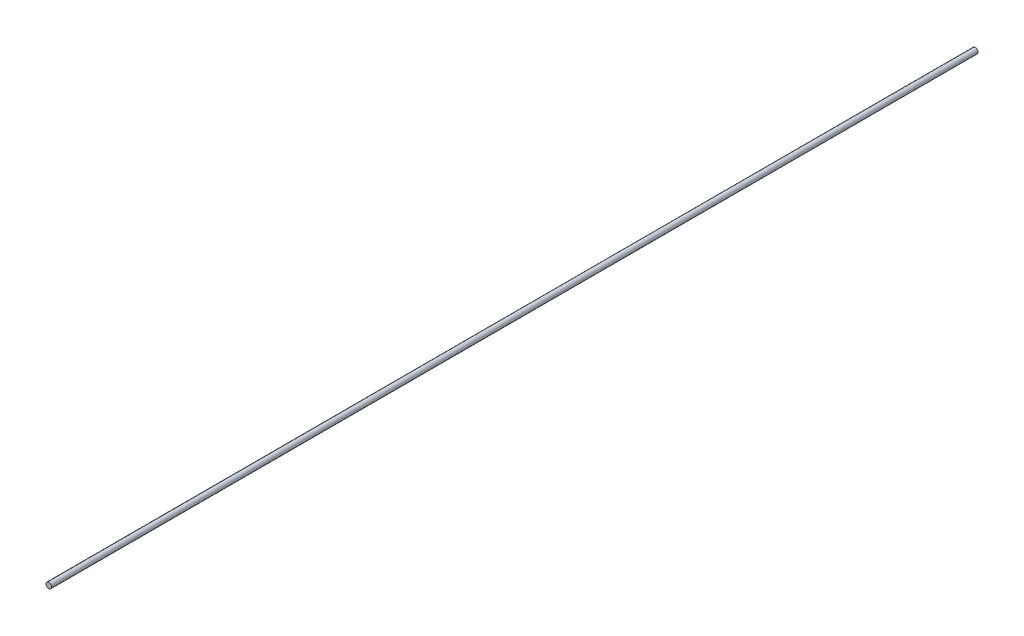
ISO-10303-21;
HEADER;
FILE_DESCRIPTION(('STEP AP214'),'2;1');
FILE_NAME('part.step','',(''),(''),'','','');
FILE_SCHEMA(('AUTOMOTIVE_DESIGN { 1 0 10303 214 1 1 1 1 }'));
ENDSEC;
DATA;
#1=APPLICATION_CONTEXT('core data for automotive mechanical design processes');
#2=APPLICATION_PROTOCOL_DEFINITION('international standard','automotive_design',2000,#1);
#3=PRODUCT_CONTEXT('',#1,'mechanical');
#4=PRODUCT('Part','Part','',(#3));
#5=PRODUCT_RELATED_PRODUCT_CATEGORY('part','',(#4));
#6=PRODUCT_DEFINITION_FORMATION('','',#4);
#7=PRODUCT_DEFINITION_CONTEXT('part definition',#1,'design');
#8=PRODUCT_DEFINITION('design','',#6,#7);
#9=PRODUCT_DEFINITION_SHAPE('','',#8);
#10=(LENGTH_UNIT() NAMED_UNIT(*) SI_UNIT(.MILLI.,.METRE.));
#11=(NAMED_UNIT(*) PLANE_ANGLE_UNIT() SI_UNIT($,.RADIAN.));
#12=(NAMED_UNIT(*) SI_UNIT($,.STERADIAN.) SOLID_ANGLE_UNIT());
#13=UNCERTAINTY_MEASURE_WITH_UNIT(LENGTH_MEASURE(1.E-05),#10,'distance_accuracy_value','');
#14=(GEOMETRIC_REPRESENTATION_CONTEXT(3) GLOBAL_UNCERTAINTY_ASSIGNED_CONTEXT((#13)) GLOBAL_UNIT_ASSIGNED_CONTEXT((#10,
#11,#12)) REPRESENTATION_CONTEXT('',''));
#15=CARTESIAN_POINT('',(0.,0.,0.));
#16=DIRECTION('',(0.,0.,1.));
#17=DIRECTION('',(1.,0.,0.));
#18=AXIS2_PLACEMENT_3D('',#15,#16,#17);
#19=CARTESIAN_POINT('',(0.,0.,450.));
#20=DIRECTION('',(0.,0.,-1.));
#21=DIRECTION('',(-1.,0.,0.));
#22=AXIS2_PLACEMENT_3D('',#19,#20,#21);
#23=CYLINDRICAL_SURFACE('',#22,1.35);
#24=CARTESIAN_POINT('',(0.,0.,450.));
#25=DIRECTION('',(0.,0.,1.));
#26=DIRECTION('',(1.,0.,0.));
#27=AXIS2_PLACEMENT_3D('',#24,#25,#26);
#28=CIRCLE('',#27,1.35);
#29=CARTESIAN_POINT('',(1.35,0.,450.));
#30=VERTEX_POINT('',#29);
#31=EDGE_CURVE('E10',#30,#30,#28,.T.);
#32=ORIENTED_EDGE('',*,*,#31,.F.);
#33=EDGE_LOOP('',(#32));
#34=FACE_BOUND('',#33,.T.);
#35=CARTESIAN_POINT('',(0.,0.,0.));
#36=DIRECTION('',(0.,0.,1.));
#37=DIRECTION('',(1.,0.,0.));
#38=AXIS2_PLACEMENT_3D('',#35,#36,#37);
#39=CIRCLE('',#38,1.35);
#40=CARTESIAN_POINT('',(1.35,0.,0.));
#41=VERTEX_POINT('',#40);
#42=EDGE_CURVE('E34',#41,#41,#39,.T.);
#43=ORIENTED_EDGE('',*,*,#42,.T.);
#44=EDGE_LOOP('',(#43));
#45=FACE_BOUND('',#44,.T.);
#46=ADVANCED_FACE('F28',(#34,#45),#23,.T.);
#47=CARTESIAN_POINT('',(0.,0.,450.));
#48=DIRECTION('',(0.,0.,1.));
#49=DIRECTION('',(1.,0.,0.));
#50=AXIS2_PLACEMENT_3D('',#47,#48,#49);
#51=PLANE('',#50);
#52=ORIENTED_EDGE('',*,*,#31,.T.);
#53=EDGE_LOOP('',(#52));
#54=FACE_BOUND('',#53,.T.);
#55=ADVANCED_FACE('F43',(#54),#51,.T.);
#56=CARTESIAN_POINT('',(0.,0.,0.));
#57=DIRECTION('',(0.,0.,1.));
#58=DIRECTION('',(1.,0.,0.));
#59=AXIS2_PLACEMENT_3D('',#56,#57,#58);
#60=PLANE('',#59);
#61=ORIENTED_EDGE('',*,*,#42,.F.);
#62=EDGE_LOOP('',(#61));
#63=FACE_BOUND('',#62,.T.);
#64=ADVANCED_FACE('F41',(#63),#60,.F.);
#65=CLOSED_SHELL('',(#46,#55,#64));
#66=MANIFOLD_SOLID_BREP('B2',#65);
#67=ADVANCED_BREP_SHAPE_REPRESENTATION('',(#18,#66),#14);
#68=SHAPE_DEFINITION_REPRESENTATION(#9,#67);
ENDSEC;
END-ISO-10303-21;
